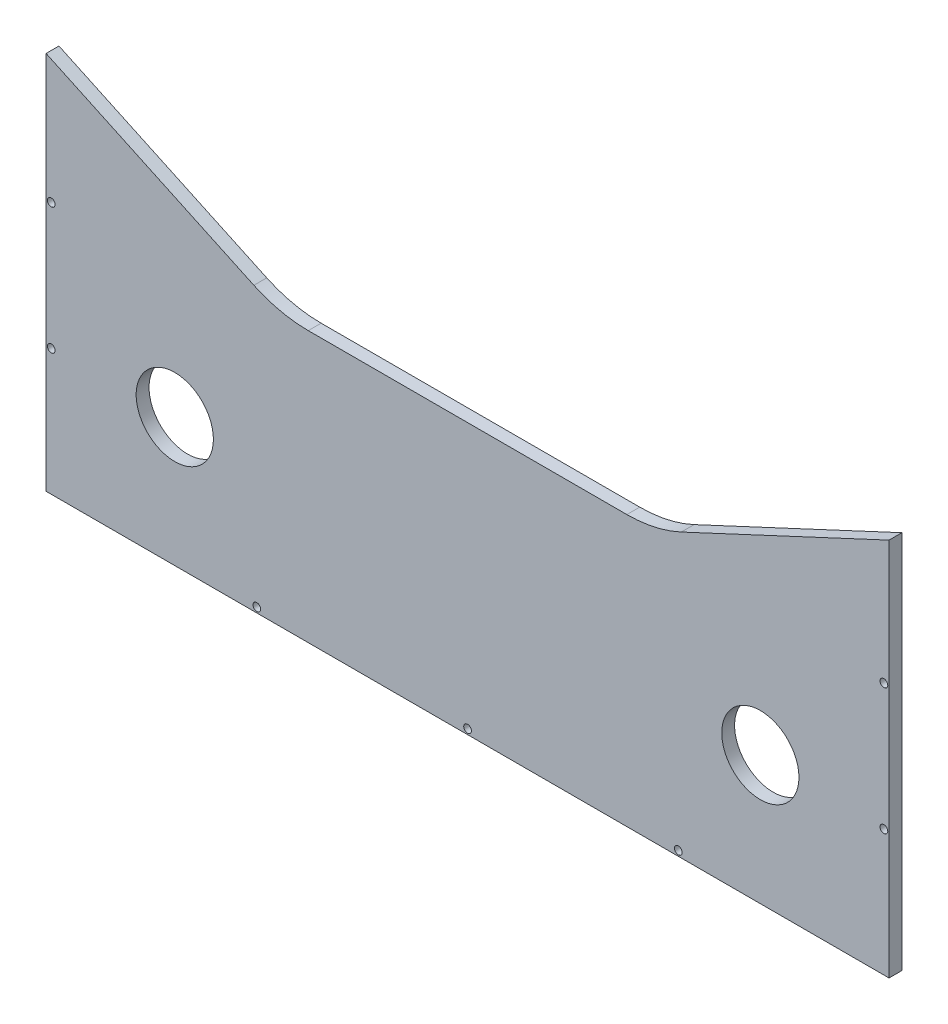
from build123d import *

# Parameters (mm, degrees)
SKETCH1_W           = 327.5
SKETCH1_H           = 105
BOSS_EXTRUDE1_DEPTH = 5
FILLET1_R           = 50
SKETCH2_R           = 15
CUT_EXTRUDE1_DEPTH  = 190.292872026
SKETCH4_R           = 1.5
CUT_EXTRUDE3_DEPTH  = 10


with BuildPart() as part:
    # Sketch1 → Boss-Extrude1 (new body)
    with BuildSketch(Plane.XY):
        Rectangle(SKETCH1_W, SKETCH1_H)
        Polygon((-163.75, 52.5), (-72.973022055, 52.5), (-163.75, 94.83), align=None)
        Polygon((163.75, 94.83), (72.973022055, 52.5), (163.75, 52.5), align=None)
    extrude(amount=BOSS_EXTRUDE1_DEPTH)

    # Fillet1
    fillet1_edges = [part.edges().sort_by_distance(p)[0] for p in [
        (-72.973022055, 52.5, 2.5),
        (72.973022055, 52.5, 2.5),
    ]]
    fillet(fillet1_edges, radius=FILLET1_R)

    # Sketch2 → Cut-Extrude1 (cut, through all)
    with BuildSketch(Plane.XY.offset(5)):
        with Locations((-113.75, -2.5)):
            Circle(SKETCH2_R)
        with Locations((113.75, -2.5)):
            Circle(SKETCH2_R)
    extrude(amount=-CUT_EXTRUDE1_DEPTH, mode=Mode.SUBTRACT)

    # Sketch4 → Cut-Extrude3 (cut)
    with BuildSketch(Plane.XY.offset(5)):
        with Locations((-161.75, 45.72)):
            Circle(SKETCH4_R)
        with Locations((-161.75, -3.39)):
            Circle(SKETCH4_R)
        with Locations((-81.875, -50.5)):
            Circle(SKETCH4_R)
        with BuildLine():
            ThreePointArc((0, -49), (-1.5, -50.5), (0, -52))
            Line((0, -52), (0, -49))
        make_face()
        with BuildLine():
            Line((0, -49), (0, -52))
            ThreePointArc((0, -52), (1.060660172, -51.560660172), (1.5, -50.5))
            ThreePointArc((1.5, -50.5), (1.060660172, -49.439339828), (0, -49))
        make_face()
        with BuildLine():
            ThreePointArc((0, -49), (-1.5, -50.5), (0, -52))
            Line((0, -52), (0, -49))
        make_face()
        with BuildLine():
            Line((0, -49), (0, -52))
            ThreePointArc((0, -52), (1.060660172, -51.560660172), (1.5, -50.5))
            ThreePointArc((1.5, -50.5), (1.060660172, -49.439339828), (0, -49))
        make_face()
        with Locations((81.875, -50.5)):
            Circle(SKETCH4_R)
        with Locations((161.75, -3.39)):
            Circle(SKETCH4_R)
        with Locations((161.75, 45.72)):
            Circle(SKETCH4_R)
    extrude(amount=-CUT_EXTRUDE3_DEPTH, mode=Mode.SUBTRACT)


solid = part.part
